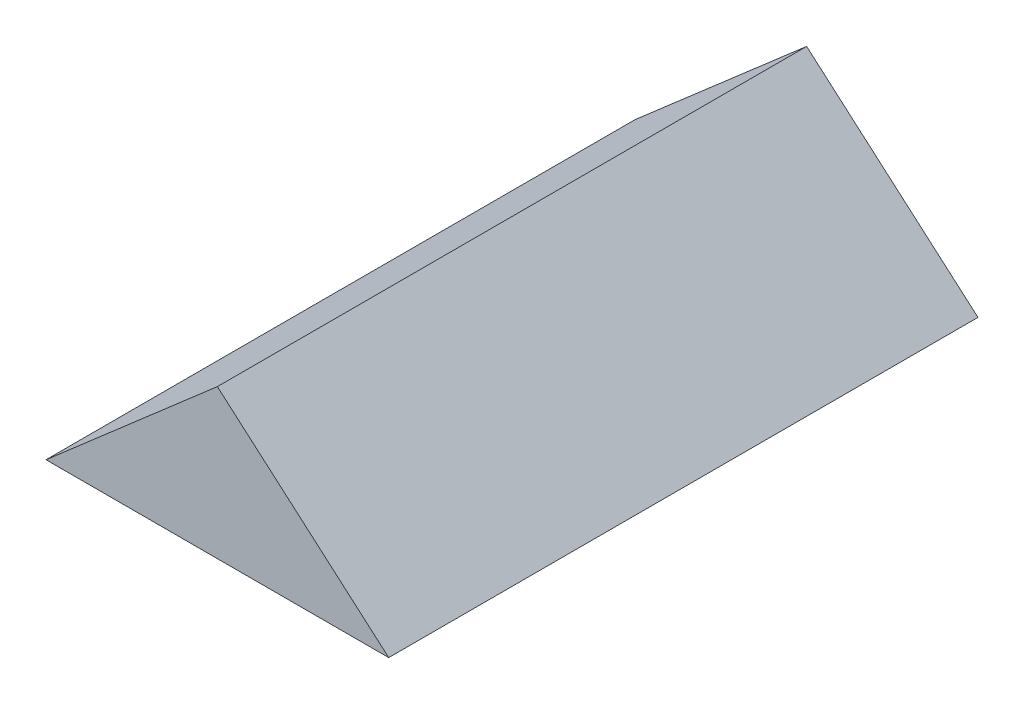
from build123d import *

# Parameters (mm, degrees)
EXTRUSION1_DEPTH = 87


with BuildPart() as part:
    # Esquisse1 → Extrusion1 (new body)
    with BuildSketch(Plane.XY):
        Polygon((0, 0), (50.6, 0), (25.3, 22), align=None)
    extrude(amount=EXTRUSION1_DEPTH)


solid = part.part
